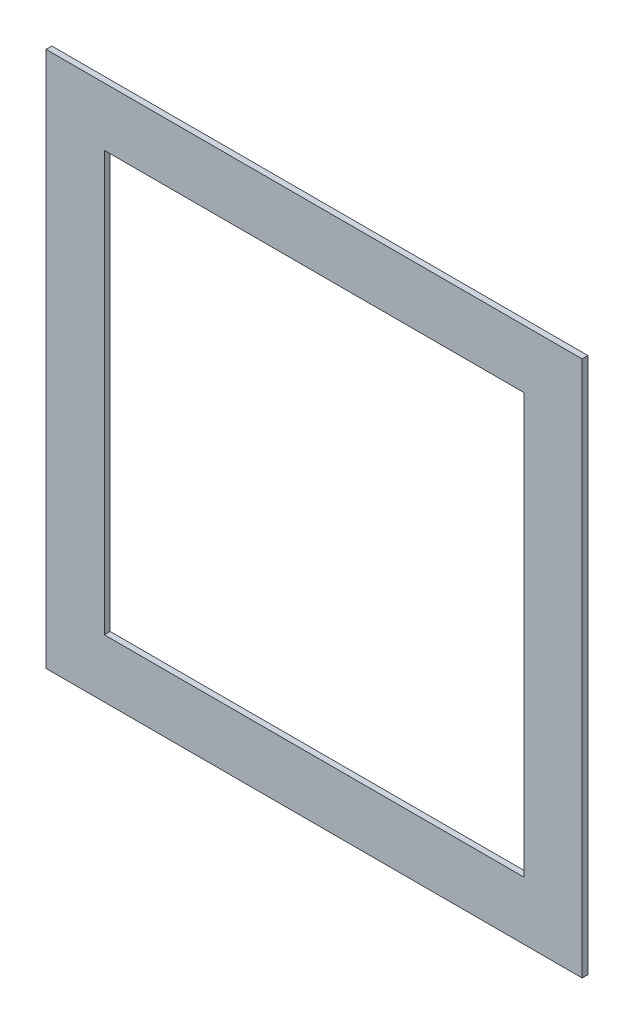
ISO-10303-21;
HEADER;
FILE_DESCRIPTION(('STEP AP214'),'2;1');
FILE_NAME('part.step','',(''),(''),'','','');
FILE_SCHEMA(('AUTOMOTIVE_DESIGN { 1 0 10303 214 1 1 1 1 }'));
ENDSEC;
DATA;
#1=APPLICATION_CONTEXT('core data for automotive mechanical design processes');
#2=APPLICATION_PROTOCOL_DEFINITION('international standard','automotive_design',2000,#1);
#3=PRODUCT_CONTEXT('',#1,'mechanical');
#4=PRODUCT('Part','Part','',(#3));
#5=PRODUCT_RELATED_PRODUCT_CATEGORY('part','',(#4));
#6=PRODUCT_DEFINITION_FORMATION('','',#4);
#7=PRODUCT_DEFINITION_CONTEXT('part definition',#1,'design');
#8=PRODUCT_DEFINITION('design','',#6,#7);
#9=PRODUCT_DEFINITION_SHAPE('','',#8);
#10=(LENGTH_UNIT() NAMED_UNIT(*) SI_UNIT(.MILLI.,.METRE.));
#11=(NAMED_UNIT(*) PLANE_ANGLE_UNIT() SI_UNIT($,.RADIAN.));
#12=(NAMED_UNIT(*) SI_UNIT($,.STERADIAN.) SOLID_ANGLE_UNIT());
#13=UNCERTAINTY_MEASURE_WITH_UNIT(LENGTH_MEASURE(1.E-05),#10,'distance_accuracy_value','');
#14=(GEOMETRIC_REPRESENTATION_CONTEXT(3) GLOBAL_UNCERTAINTY_ASSIGNED_CONTEXT((#13)) GLOBAL_UNIT_ASSIGNED_CONTEXT((#10,
#11,#12)) REPRESENTATION_CONTEXT('',''));
#15=CARTESIAN_POINT('',(0.,0.,0.));
#16=DIRECTION('',(0.,0.,1.));
#17=DIRECTION('',(1.,0.,0.));
#18=AXIS2_PLACEMENT_3D('',#15,#16,#17);
#19=CARTESIAN_POINT('',(0.,0.,2.5));
#20=DIRECTION('',(0.,0.,1.));
#21=DIRECTION('',(1.,0.,0.));
#22=AXIS2_PLACEMENT_3D('',#19,#20,#21);
#23=PLANE('',#22);
#24=DIRECTION('',(0.,-1.,0.));
#25=VECTOR('',#24,1.);
#26=CARTESIAN_POINT('',(-230.,230.,2.5));
#27=LINE('',#26,#25);
#28=CARTESIAN_POINT('',(-230.,230.,2.5));
#29=VERTEX_POINT('',#28);
#30=CARTESIAN_POINT('',(-230.,-230.,2.5));
#31=VERTEX_POINT('',#30);
#32=EDGE_CURVE('E153',#29,#31,#27,.T.);
#33=ORIENTED_EDGE('',*,*,#32,.T.);
#34=DIRECTION('',(1.,0.,0.));
#35=VECTOR('',#34,1.);
#36=CARTESIAN_POINT('',(-230.,-230.,2.5));
#37=LINE('',#36,#35);
#38=CARTESIAN_POINT('',(230.,-230.,2.5));
#39=VERTEX_POINT('',#38);
#40=EDGE_CURVE('E157',#31,#39,#37,.T.);
#41=ORIENTED_EDGE('',*,*,#40,.T.);
#42=DIRECTION('',(0.,1.,0.));
#43=VECTOR('',#42,1.);
#44=CARTESIAN_POINT('',(230.,230.,2.5));
#45=LINE('',#44,#43);
#46=CARTESIAN_POINT('',(230.,230.,2.5));
#47=VERTEX_POINT('',#46);
#48=EDGE_CURVE('E161',#39,#47,#45,.T.);
#49=ORIENTED_EDGE('',*,*,#48,.T.);
#50=DIRECTION('',(-1.,0.,0.));
#51=VECTOR('',#50,1.);
#52=CARTESIAN_POINT('',(-230.,230.,2.5));
#53=LINE('',#52,#51);
#54=EDGE_CURVE('E164',#47,#29,#53,.T.);
#55=ORIENTED_EDGE('',*,*,#54,.T.);
#56=EDGE_LOOP('',(#33,#41,#49,#55));
#57=FACE_BOUND('',#56,.T.);
#58=DIRECTION('',(-1.,0.,0.));
#59=VECTOR('',#58,1.);
#60=CARTESIAN_POINT('',(-180.,180.,2.5));
#61=LINE('',#60,#59);
#62=CARTESIAN_POINT('',(180.,180.,2.5));
#63=VERTEX_POINT('',#62);
#64=CARTESIAN_POINT('',(-180.,180.,2.5));
#65=VERTEX_POINT('',#64);
#66=EDGE_CURVE('E114',#63,#65,#61,.T.);
#67=ORIENTED_EDGE('',*,*,#66,.F.);
#68=DIRECTION('',(0.,1.,0.));
#69=VECTOR('',#68,1.);
#70=CARTESIAN_POINT('',(180.,180.,2.5));
#71=LINE('',#70,#69);
#72=CARTESIAN_POINT('',(180.,-180.,2.5));
#73=VERTEX_POINT('',#72);
#74=EDGE_CURVE('E105',#73,#63,#71,.T.);
#75=ORIENTED_EDGE('',*,*,#74,.F.);
#76=DIRECTION('',(1.,0.,0.));
#77=VECTOR('',#76,1.);
#78=CARTESIAN_POINT('',(-180.,-180.,2.5));
#79=LINE('',#78,#77);
#80=CARTESIAN_POINT('',(-180.,-180.,2.5));
#81=VERTEX_POINT('',#80);
#82=EDGE_CURVE('E131',#81,#73,#79,.T.);
#83=ORIENTED_EDGE('',*,*,#82,.F.);
#84=DIRECTION('',(0.,-1.,0.));
#85=VECTOR('',#84,1.);
#86=CARTESIAN_POINT('',(-180.,180.,2.5));
#87=LINE('',#86,#85);
#88=EDGE_CURVE('E127',#65,#81,#87,.T.);
#89=ORIENTED_EDGE('',*,*,#88,.F.);
#90=EDGE_LOOP('',(#67,#75,#83,#89));
#91=FACE_BOUND('',#90,.T.);
#92=ADVANCED_FACE('F39',(#57,#91),#23,.T.);
#93=CARTESIAN_POINT('',(0.,0.,-2.5));
#94=DIRECTION('',(0.,0.,1.));
#95=DIRECTION('',(1.,0.,0.));
#96=AXIS2_PLACEMENT_3D('',#93,#94,#95);
#97=PLANE('',#96);
#98=DIRECTION('',(0.,-1.,0.));
#99=VECTOR('',#98,1.);
#100=CARTESIAN_POINT('',(-230.,230.,-2.5));
#101=LINE('',#100,#99);
#102=CARTESIAN_POINT('',(-230.,230.,-2.5));
#103=VERTEX_POINT('',#102);
#104=CARTESIAN_POINT('',(-230.,-230.,-2.5));
#105=VERTEX_POINT('',#104);
#106=EDGE_CURVE('E123',#103,#105,#101,.T.);
#107=ORIENTED_EDGE('',*,*,#106,.F.);
#108=DIRECTION('',(-1.,0.,0.));
#109=VECTOR('',#108,1.);
#110=CARTESIAN_POINT('',(-230.,230.,-2.5));
#111=LINE('',#110,#109);
#112=CARTESIAN_POINT('',(230.,230.,-2.5));
#113=VERTEX_POINT('',#112);
#114=EDGE_CURVE('E158',#113,#103,#111,.T.);
#115=ORIENTED_EDGE('',*,*,#114,.F.);
#116=DIRECTION('',(0.,1.,0.));
#117=VECTOR('',#116,1.);
#118=CARTESIAN_POINT('',(230.,230.,-2.5));
#119=LINE('',#118,#117);
#120=CARTESIAN_POINT('',(230.,-230.,-2.5));
#121=VERTEX_POINT('',#120);
#122=EDGE_CURVE('E174',#121,#113,#119,.T.);
#123=ORIENTED_EDGE('',*,*,#122,.F.);
#124=DIRECTION('',(1.,0.,0.));
#125=VECTOR('',#124,1.);
#126=CARTESIAN_POINT('',(-230.,-230.,-2.5));
#127=LINE('',#126,#125);
#128=EDGE_CURVE('E171',#105,#121,#127,.T.);
#129=ORIENTED_EDGE('',*,*,#128,.F.);
#130=EDGE_LOOP('',(#107,#115,#123,#129));
#131=FACE_BOUND('',#130,.T.);
#132=DIRECTION('',(0.,1.,0.));
#133=VECTOR('',#132,1.);
#134=CARTESIAN_POINT('',(180.,180.,-2.5));
#135=LINE('',#134,#133);
#136=CARTESIAN_POINT('',(180.,-180.,-2.5));
#137=VERTEX_POINT('',#136);
#138=CARTESIAN_POINT('',(180.,180.,-2.5));
#139=VERTEX_POINT('',#138);
#140=EDGE_CURVE('E63',#137,#139,#135,.T.);
#141=ORIENTED_EDGE('',*,*,#140,.T.);
#142=DIRECTION('',(-1.,0.,0.));
#143=VECTOR('',#142,1.);
#144=CARTESIAN_POINT('',(-180.,180.,-2.5));
#145=LINE('',#144,#143);
#146=CARTESIAN_POINT('',(-180.,180.,-2.5));
#147=VERTEX_POINT('',#146);
#148=EDGE_CURVE('E121',#139,#147,#145,.T.);
#149=ORIENTED_EDGE('',*,*,#148,.T.);
#150=DIRECTION('',(0.,-1.,0.));
#151=VECTOR('',#150,1.);
#152=CARTESIAN_POINT('',(-180.,180.,-2.5));
#153=LINE('',#152,#151);
#154=CARTESIAN_POINT('',(-180.,-180.,-2.5));
#155=VERTEX_POINT('',#154);
#156=EDGE_CURVE('E140',#147,#155,#153,.T.);
#157=ORIENTED_EDGE('',*,*,#156,.T.);
#158=DIRECTION('',(1.,0.,0.));
#159=VECTOR('',#158,1.);
#160=CARTESIAN_POINT('',(-180.,-180.,-2.5));
#161=LINE('',#160,#159);
#162=EDGE_CURVE('E115',#155,#137,#161,.T.);
#163=ORIENTED_EDGE('',*,*,#162,.T.);
#164=EDGE_LOOP('',(#141,#149,#157,#163));
#165=FACE_BOUND('',#164,.T.);
#166=ADVANCED_FACE('F197',(#131,#165),#97,.F.);
#167=CARTESIAN_POINT('',(-230.,230.,2.5));
#168=DIRECTION('',(1.,0.,0.));
#169=DIRECTION('',(0.,1.,0.));
#170=AXIS2_PLACEMENT_3D('',#167,#168,#169);
#171=PLANE('',#170);
#172=ORIENTED_EDGE('',*,*,#106,.T.);
#173=DIRECTION('',(0.,0.,-1.));
#174=VECTOR('',#173,1.);
#175=CARTESIAN_POINT('',(-230.,-230.,2.5));
#176=LINE('',#175,#174);
#177=EDGE_CURVE('E11',#31,#105,#176,.T.);
#178=ORIENTED_EDGE('',*,*,#177,.F.);
#179=ORIENTED_EDGE('',*,*,#32,.F.);
#180=DIRECTION('',(0.,0.,-1.));
#181=VECTOR('',#180,1.);
#182=CARTESIAN_POINT('',(-230.,230.,2.5));
#183=LINE('',#182,#181);
#184=EDGE_CURVE('E167',#29,#103,#183,.T.);
#185=ORIENTED_EDGE('',*,*,#184,.T.);
#186=EDGE_LOOP('',(#172,#178,#179,#185));
#187=FACE_BOUND('',#186,.T.);
#188=ADVANCED_FACE('F41',(#187),#171,.F.);
#189=CARTESIAN_POINT('',(-230.,-230.,2.5));
#190=DIRECTION('',(0.,1.,0.));
#191=DIRECTION('',(-1.,0.,0.));
#192=AXIS2_PLACEMENT_3D('',#189,#190,#191);
#193=PLANE('',#192);
#194=ORIENTED_EDGE('',*,*,#128,.T.);
#195=DIRECTION('',(0.,0.,-1.));
#196=VECTOR('',#195,1.);
#197=CARTESIAN_POINT('',(230.,-230.,2.5));
#198=LINE('',#197,#196);
#199=EDGE_CURVE('E48',#39,#121,#198,.T.);
#200=ORIENTED_EDGE('',*,*,#199,.F.);
#201=ORIENTED_EDGE('',*,*,#40,.F.);
#202=ORIENTED_EDGE('',*,*,#177,.T.);
#203=EDGE_LOOP('',(#194,#200,#201,#202));
#204=FACE_BOUND('',#203,.T.);
#205=ADVANCED_FACE('F207',(#204),#193,.F.);
#206=CARTESIAN_POINT('',(230.,230.,2.5));
#207=DIRECTION('',(-1.,0.,0.));
#208=DIRECTION('',(0.,0.,1.));
#209=AXIS2_PLACEMENT_3D('',#206,#207,#208);
#210=PLANE('',#209);
#211=ORIENTED_EDGE('',*,*,#122,.T.);
#212=DIRECTION('',(0.,0.,-1.));
#213=VECTOR('',#212,1.);
#214=CARTESIAN_POINT('',(230.,230.,2.5));
#215=LINE('',#214,#213);
#216=EDGE_CURVE('E182',#47,#113,#215,.T.);
#217=ORIENTED_EDGE('',*,*,#216,.F.);
#218=ORIENTED_EDGE('',*,*,#48,.F.);
#219=ORIENTED_EDGE('',*,*,#199,.T.);
#220=EDGE_LOOP('',(#211,#217,#218,#219));
#221=FACE_BOUND('',#220,.T.);
#222=ADVANCED_FACE('F191',(#221),#210,.F.);
#223=CARTESIAN_POINT('',(-230.,230.,2.5));
#224=DIRECTION('',(0.,-1.,0.));
#225=DIRECTION('',(0.,0.,-1.));
#226=AXIS2_PLACEMENT_3D('',#223,#224,#225);
#227=PLANE('',#226);
#228=ORIENTED_EDGE('',*,*,#114,.T.);
#229=ORIENTED_EDGE('',*,*,#184,.F.);
#230=ORIENTED_EDGE('',*,*,#54,.F.);
#231=ORIENTED_EDGE('',*,*,#216,.T.);
#232=EDGE_LOOP('',(#228,#229,#230,#231));
#233=FACE_BOUND('',#232,.T.);
#234=ADVANCED_FACE('F201',(#233),#227,.F.);
#235=CARTESIAN_POINT('',(180.,180.,2.5));
#236=DIRECTION('',(-1.,0.,0.));
#237=DIRECTION('',(0.,-1.,0.));
#238=AXIS2_PLACEMENT_3D('',#235,#236,#237);
#239=PLANE('',#238);
#240=ORIENTED_EDGE('',*,*,#140,.F.);
#241=DIRECTION('',(0.,0.,-1.));
#242=VECTOR('',#241,1.);
#243=CARTESIAN_POINT('',(180.,-180.,2.5));
#244=LINE('',#243,#242);
#245=EDGE_CURVE('E109',#73,#137,#244,.T.);
#246=ORIENTED_EDGE('',*,*,#245,.F.);
#247=ORIENTED_EDGE('',*,*,#74,.T.);
#248=DIRECTION('',(0.,0.,-1.));
#249=VECTOR('',#248,1.);
#250=CARTESIAN_POINT('',(180.,180.,2.5));
#251=LINE('',#250,#249);
#252=EDGE_CURVE('E108',#63,#139,#251,.T.);
#253=ORIENTED_EDGE('',*,*,#252,.T.);
#254=EDGE_LOOP('',(#240,#246,#247,#253));
#255=FACE_BOUND('',#254,.T.);
#256=ADVANCED_FACE('F107',(#255),#239,.T.);
#257=CARTESIAN_POINT('',(-180.,180.,2.5));
#258=DIRECTION('',(0.,-1.,0.));
#259=DIRECTION('',(0.,0.,-1.));
#260=AXIS2_PLACEMENT_3D('',#257,#258,#259);
#261=PLANE('',#260);
#262=ORIENTED_EDGE('',*,*,#148,.F.);
#263=ORIENTED_EDGE('',*,*,#252,.F.);
#264=ORIENTED_EDGE('',*,*,#66,.T.);
#265=DIRECTION('',(0.,0.,-1.));
#266=VECTOR('',#265,1.);
#267=CARTESIAN_POINT('',(-180.,180.,2.5));
#268=LINE('',#267,#266);
#269=EDGE_CURVE('E124',#65,#147,#268,.T.);
#270=ORIENTED_EDGE('',*,*,#269,.T.);
#271=EDGE_LOOP('',(#262,#263,#264,#270));
#272=FACE_BOUND('',#271,.T.);
#273=ADVANCED_FACE('F118',(#272),#261,.T.);
#274=CARTESIAN_POINT('',(-180.,180.,2.5));
#275=DIRECTION('',(1.,0.,0.));
#276=DIRECTION('',(0.,1.,0.));
#277=AXIS2_PLACEMENT_3D('',#274,#275,#276);
#278=PLANE('',#277);
#279=ORIENTED_EDGE('',*,*,#156,.F.);
#280=ORIENTED_EDGE('',*,*,#269,.F.);
#281=ORIENTED_EDGE('',*,*,#88,.T.);
#282=DIRECTION('',(0.,0.,-1.));
#283=VECTOR('',#282,1.);
#284=CARTESIAN_POINT('',(-180.,-180.,2.5));
#285=LINE('',#284,#283);
#286=EDGE_CURVE('E55',#81,#155,#285,.T.);
#287=ORIENTED_EDGE('',*,*,#286,.T.);
#288=EDGE_LOOP('',(#279,#280,#281,#287));
#289=FACE_BOUND('',#288,.T.);
#290=ADVANCED_FACE('F230',(#289),#278,.T.);
#291=CARTESIAN_POINT('',(-180.,-180.,2.5));
#292=DIRECTION('',(0.,1.,0.));
#293=DIRECTION('',(0.,0.,1.));
#294=AXIS2_PLACEMENT_3D('',#291,#292,#293);
#295=PLANE('',#294);
#296=ORIENTED_EDGE('',*,*,#162,.F.);
#297=ORIENTED_EDGE('',*,*,#286,.F.);
#298=ORIENTED_EDGE('',*,*,#82,.T.);
#299=ORIENTED_EDGE('',*,*,#245,.T.);
#300=EDGE_LOOP('',(#296,#297,#298,#299));
#301=FACE_BOUND('',#300,.T.);
#302=ADVANCED_FACE('F234',(#301),#295,.T.);
#303=CLOSED_SHELL('',(#92,#166,#188,#205,#222,#234,#256,#273,#290,#302));
#304=MANIFOLD_SOLID_BREP('B2',#303);
#305=ADVANCED_BREP_SHAPE_REPRESENTATION('',(#18,#304),#14);
#306=SHAPE_DEFINITION_REPRESENTATION(#9,#305);
ENDSEC;
END-ISO-10303-21;
